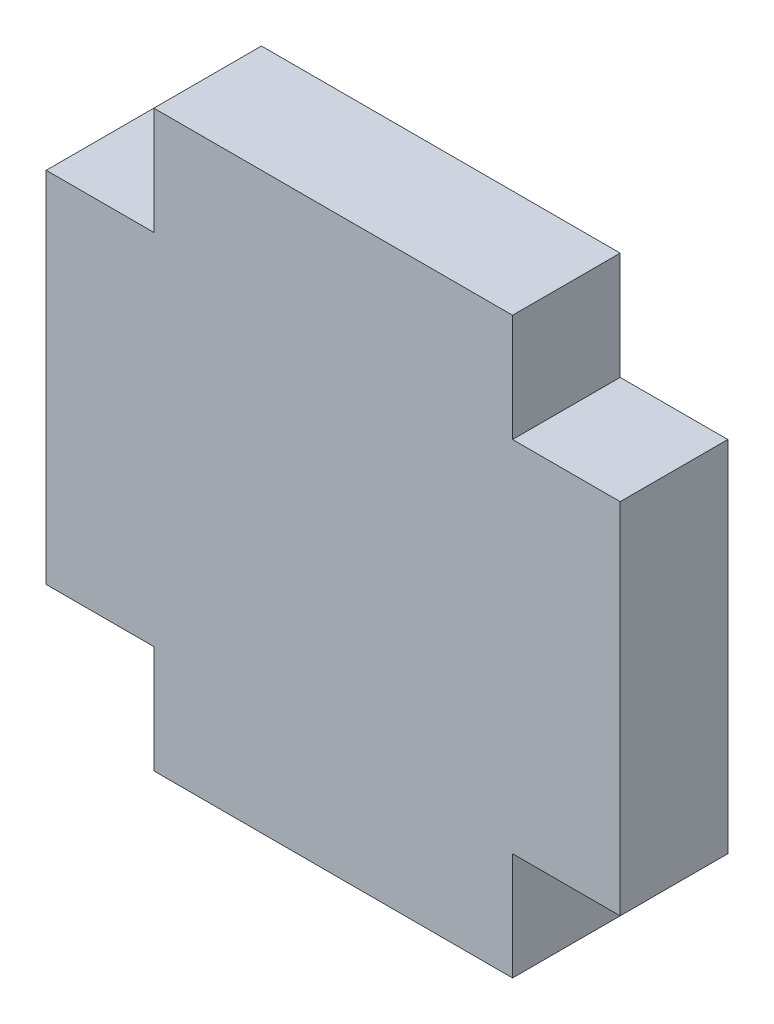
ISO-10303-21;
HEADER;
FILE_DESCRIPTION(('STEP AP214'),'2;1');
FILE_NAME('part.step','',(''),(''),'','','');
FILE_SCHEMA(('AUTOMOTIVE_DESIGN { 1 0 10303 214 1 1 1 1 }'));
ENDSEC;
DATA;
#1=APPLICATION_CONTEXT('core data for automotive mechanical design processes');
#2=APPLICATION_PROTOCOL_DEFINITION('international standard','automotive_design',2000,#1);
#3=PRODUCT_CONTEXT('',#1,'mechanical');
#4=PRODUCT('Part','Part','',(#3));
#5=PRODUCT_RELATED_PRODUCT_CATEGORY('part','',(#4));
#6=PRODUCT_DEFINITION_FORMATION('','',#4);
#7=PRODUCT_DEFINITION_CONTEXT('part definition',#1,'design');
#8=PRODUCT_DEFINITION('design','',#6,#7);
#9=PRODUCT_DEFINITION_SHAPE('','',#8);
#10=(LENGTH_UNIT() NAMED_UNIT(*) SI_UNIT(.MILLI.,.METRE.));
#11=(NAMED_UNIT(*) PLANE_ANGLE_UNIT() SI_UNIT($,.RADIAN.));
#12=(NAMED_UNIT(*) SI_UNIT($,.STERADIAN.) SOLID_ANGLE_UNIT());
#13=UNCERTAINTY_MEASURE_WITH_UNIT(LENGTH_MEASURE(1.E-05),#10,'distance_accuracy_value','');
#14=(GEOMETRIC_REPRESENTATION_CONTEXT(3) GLOBAL_UNCERTAINTY_ASSIGNED_CONTEXT((#13)) GLOBAL_UNIT_ASSIGNED_CONTEXT((#10,
#11,#12)) REPRESENTATION_CONTEXT('',''));
#15=CARTESIAN_POINT('',(0.,0.,0.));
#16=DIRECTION('',(0.,0.,1.));
#17=DIRECTION('',(1.,0.,0.));
#18=AXIS2_PLACEMENT_3D('',#15,#16,#17);
#19=CARTESIAN_POINT('',(5.,5.,3.));
#20=DIRECTION('',(-1.,0.,0.));
#21=DIRECTION('',(0.,-1.,0.));
#22=AXIS2_PLACEMENT_3D('',#19,#20,#21);
#23=PLANE('',#22);
#24=DIRECTION('',(0.,1.,0.));
#25=VECTOR('',#24,1.);
#26=CARTESIAN_POINT('',(5.,5.,0.));
#27=LINE('',#26,#25);
#28=CARTESIAN_POINT('',(5.,5.,0.));
#29=VERTEX_POINT('',#28);
#30=CARTESIAN_POINT('',(5.,8.,0.));
#31=VERTEX_POINT('',#30);
#32=EDGE_CURVE('E159',#29,#31,#27,.T.);
#33=ORIENTED_EDGE('',*,*,#32,.T.);
#34=DIRECTION('',(0.,0.,-1.));
#35=VECTOR('',#34,1.);
#36=CARTESIAN_POINT('',(5.,8.,3.));
#37=LINE('',#36,#35);
#38=CARTESIAN_POINT('',(5.,8.,3.));
#39=VERTEX_POINT('',#38);
#40=EDGE_CURVE('E11',#39,#31,#37,.T.);
#41=ORIENTED_EDGE('',*,*,#40,.F.);
#42=DIRECTION('',(0.,1.,0.));
#43=VECTOR('',#42,1.);
#44=CARTESIAN_POINT('',(5.,5.,3.));
#45=LINE('',#44,#43);
#46=CARTESIAN_POINT('',(5.,5.,3.));
#47=VERTEX_POINT('',#46);
#48=EDGE_CURVE('E181',#47,#39,#45,.T.);
#49=ORIENTED_EDGE('',*,*,#48,.F.);
#50=DIRECTION('',(0.,0.,-1.));
#51=VECTOR('',#50,1.);
#52=CARTESIAN_POINT('',(5.,5.,3.));
#53=LINE('',#52,#51);
#54=EDGE_CURVE('E151',#47,#29,#53,.T.);
#55=ORIENTED_EDGE('',*,*,#54,.T.);
#56=EDGE_LOOP('',(#33,#41,#49,#55));
#57=FACE_BOUND('',#56,.T.);
#58=ADVANCED_FACE('F39',(#57),#23,.F.);
#59=CARTESIAN_POINT('',(-5.,8.,3.));
#60=DIRECTION('',(0.,-1.,0.));
#61=DIRECTION('',(0.,0.,-1.));
#62=AXIS2_PLACEMENT_3D('',#59,#60,#61);
#63=PLANE('',#62);
#64=DIRECTION('',(-1.,0.,0.));
#65=VECTOR('',#64,1.);
#66=CARTESIAN_POINT('',(-5.,8.,0.));
#67=LINE('',#66,#65);
#68=CARTESIAN_POINT('',(-5.,8.,0.));
#69=VERTEX_POINT('',#68);
#70=EDGE_CURVE('E165',#31,#69,#67,.T.);
#71=ORIENTED_EDGE('',*,*,#70,.T.);
#72=DIRECTION('',(0.,0.,-1.));
#73=VECTOR('',#72,1.);
#74=CARTESIAN_POINT('',(-5.,8.,3.));
#75=LINE('',#74,#73);
#76=CARTESIAN_POINT('',(-5.,8.,3.));
#77=VERTEX_POINT('',#76);
#78=EDGE_CURVE('E50',#77,#69,#75,.T.);
#79=ORIENTED_EDGE('',*,*,#78,.F.);
#80=DIRECTION('',(-1.,0.,0.));
#81=VECTOR('',#80,1.);
#82=CARTESIAN_POINT('',(-5.,8.,3.));
#83=LINE('',#82,#81);
#84=EDGE_CURVE('E106',#39,#77,#83,.T.);
#85=ORIENTED_EDGE('',*,*,#84,.F.);
#86=ORIENTED_EDGE('',*,*,#40,.T.);
#87=EDGE_LOOP('',(#71,#79,#85,#86));
#88=FACE_BOUND('',#87,.T.);
#89=ADVANCED_FACE('F260',(#88),#63,.F.);
#90=CARTESIAN_POINT('',(-5.,5.,3.));
#91=DIRECTION('',(1.,0.,0.));
#92=DIRECTION('',(0.,1.,0.));
#93=AXIS2_PLACEMENT_3D('',#90,#91,#92);
#94=PLANE('',#93);
#95=DIRECTION('',(0.,-1.,0.));
#96=VECTOR('',#95,1.);
#97=CARTESIAN_POINT('',(-5.,5.,0.));
#98=LINE('',#97,#96);
#99=CARTESIAN_POINT('',(-5.,5.,0.));
#100=VERTEX_POINT('',#99);
#101=EDGE_CURVE('E164',#69,#100,#98,.T.);
#102=ORIENTED_EDGE('',*,*,#101,.T.);
#103=DIRECTION('',(0.,0.,-1.));
#104=VECTOR('',#103,1.);
#105=CARTESIAN_POINT('',(-5.,5.,3.));
#106=LINE('',#105,#104);
#107=CARTESIAN_POINT('',(-5.,5.,3.));
#108=VERTEX_POINT('',#107);
#109=EDGE_CURVE('E196',#108,#100,#106,.T.);
#110=ORIENTED_EDGE('',*,*,#109,.F.);
#111=DIRECTION('',(0.,-1.,0.));
#112=VECTOR('',#111,1.);
#113=CARTESIAN_POINT('',(-5.,5.,3.));
#114=LINE('',#113,#112);
#115=EDGE_CURVE('E208',#77,#108,#114,.T.);
#116=ORIENTED_EDGE('',*,*,#115,.F.);
#117=ORIENTED_EDGE('',*,*,#78,.T.);
#118=EDGE_LOOP('',(#102,#110,#116,#117));
#119=FACE_BOUND('',#118,.T.);
#120=ADVANCED_FACE('F207',(#119),#94,.F.);
#121=CARTESIAN_POINT('',(-5.,5.,3.));
#122=DIRECTION('',(0.,-1.,0.));
#123=DIRECTION('',(1.,0.,0.));
#124=AXIS2_PLACEMENT_3D('',#121,#122,#123);
#125=PLANE('',#124);
#126=DIRECTION('',(-1.,0.,0.));
#127=VECTOR('',#126,1.);
#128=CARTESIAN_POINT('',(-5.,5.,0.));
#129=LINE('',#128,#127);
#130=CARTESIAN_POINT('',(-8.,5.,0.));
#131=VERTEX_POINT('',#130);
#132=EDGE_CURVE('E168',#100,#131,#129,.T.);
#133=ORIENTED_EDGE('',*,*,#132,.T.);
#134=DIRECTION('',(0.,0.,-1.));
#135=VECTOR('',#134,1.);
#136=CARTESIAN_POINT('',(-8.,5.,3.));
#137=LINE('',#136,#135);
#138=CARTESIAN_POINT('',(-8.,5.,3.));
#139=VERTEX_POINT('',#138);
#140=EDGE_CURVE('E200',#139,#131,#137,.T.);
#141=ORIENTED_EDGE('',*,*,#140,.F.);
#142=DIRECTION('',(-1.,0.,0.));
#143=VECTOR('',#142,1.);
#144=CARTESIAN_POINT('',(-5.,5.,3.));
#145=LINE('',#144,#143);
#146=EDGE_CURVE('E226',#108,#139,#145,.T.);
#147=ORIENTED_EDGE('',*,*,#146,.F.);
#148=ORIENTED_EDGE('',*,*,#109,.T.);
#149=EDGE_LOOP('',(#133,#141,#147,#148));
#150=FACE_BOUND('',#149,.T.);
#151=ADVANCED_FACE('F220',(#150),#125,.F.);
#152=CARTESIAN_POINT('',(-8.,5.,3.));
#153=DIRECTION('',(1.,0.,0.));
#154=DIRECTION('',(0.,0.,-1.));
#155=AXIS2_PLACEMENT_3D('',#152,#153,#154);
#156=PLANE('',#155);
#157=DIRECTION('',(0.,-1.,0.));
#158=VECTOR('',#157,1.);
#159=CARTESIAN_POINT('',(-8.,5.,0.));
#160=LINE('',#159,#158);
#161=CARTESIAN_POINT('',(-8.,-5.,0.));
#162=VERTEX_POINT('',#161);
#163=EDGE_CURVE('E166',#131,#162,#160,.T.);
#164=ORIENTED_EDGE('',*,*,#163,.T.);
#165=DIRECTION('',(0.,0.,-1.));
#166=VECTOR('',#165,1.);
#167=CARTESIAN_POINT('',(-8.,-5.,3.));
#168=LINE('',#167,#166);
#169=CARTESIAN_POINT('',(-8.,-5.,3.));
#170=VERTEX_POINT('',#169);
#171=EDGE_CURVE('E191',#170,#162,#168,.T.);
#172=ORIENTED_EDGE('',*,*,#171,.F.);
#173=DIRECTION('',(0.,-1.,0.));
#174=VECTOR('',#173,1.);
#175=CARTESIAN_POINT('',(-8.,5.,3.));
#176=LINE('',#175,#174);
#177=EDGE_CURVE('E223',#139,#170,#176,.T.);
#178=ORIENTED_EDGE('',*,*,#177,.F.);
#179=ORIENTED_EDGE('',*,*,#140,.T.);
#180=EDGE_LOOP('',(#164,#172,#178,#179));
#181=FACE_BOUND('',#180,.T.);
#182=ADVANCED_FACE('F221',(#181),#156,.F.);
#183=CARTESIAN_POINT('',(-5.,-5.,3.));
#184=DIRECTION('',(0.,1.,0.));
#185=DIRECTION('',(0.,0.,1.));
#186=AXIS2_PLACEMENT_3D('',#183,#184,#185);
#187=PLANE('',#186);
#188=DIRECTION('',(1.,0.,0.));
#189=VECTOR('',#188,1.);
#190=CARTESIAN_POINT('',(-5.,-5.,0.));
#191=LINE('',#190,#189);
#192=CARTESIAN_POINT('',(-5.,-5.,0.));
#193=VERTEX_POINT('',#192);
#194=EDGE_CURVE('E169',#162,#193,#191,.T.);
#195=ORIENTED_EDGE('',*,*,#194,.T.);
#196=DIRECTION('',(0.,0.,-1.));
#197=VECTOR('',#196,1.);
#198=CARTESIAN_POINT('',(-5.,-5.,3.));
#199=LINE('',#198,#197);
#200=CARTESIAN_POINT('',(-5.,-5.,3.));
#201=VERTEX_POINT('',#200);
#202=EDGE_CURVE('E192',#201,#193,#199,.T.);
#203=ORIENTED_EDGE('',*,*,#202,.F.);
#204=DIRECTION('',(1.,0.,0.));
#205=VECTOR('',#204,1.);
#206=CARTESIAN_POINT('',(-5.,-5.,3.));
#207=LINE('',#206,#205);
#208=EDGE_CURVE('E224',#170,#201,#207,.T.);
#209=ORIENTED_EDGE('',*,*,#208,.F.);
#210=ORIENTED_EDGE('',*,*,#171,.T.);
#211=EDGE_LOOP('',(#195,#203,#209,#210));
#212=FACE_BOUND('',#211,.T.);
#213=ADVANCED_FACE('F275',(#212),#187,.F.);
#214=CARTESIAN_POINT('',(-5.,-5.,3.));
#215=DIRECTION('',(1.,0.,0.));
#216=DIRECTION('',(0.,1.,0.));
#217=AXIS2_PLACEMENT_3D('',#214,#215,#216);
#218=PLANE('',#217);
#219=DIRECTION('',(0.,-1.,0.));
#220=VECTOR('',#219,1.);
#221=CARTESIAN_POINT('',(-5.,-5.,0.));
#222=LINE('',#221,#220);
#223=CARTESIAN_POINT('',(-5.,-8.,0.));
#224=VERTEX_POINT('',#223);
#225=EDGE_CURVE('E175',#193,#224,#222,.T.);
#226=ORIENTED_EDGE('',*,*,#225,.T.);
#227=DIRECTION('',(0.,0.,-1.));
#228=VECTOR('',#227,1.);
#229=CARTESIAN_POINT('',(-5.,-8.,3.));
#230=LINE('',#229,#228);
#231=CARTESIAN_POINT('',(-5.,-8.,3.));
#232=VERTEX_POINT('',#231);
#233=EDGE_CURVE('E187',#232,#224,#230,.T.);
#234=ORIENTED_EDGE('',*,*,#233,.F.);
#235=DIRECTION('',(0.,-1.,0.));
#236=VECTOR('',#235,1.);
#237=CARTESIAN_POINT('',(-5.,-5.,3.));
#238=LINE('',#237,#236);
#239=EDGE_CURVE('E228',#201,#232,#238,.T.);
#240=ORIENTED_EDGE('',*,*,#239,.F.);
#241=ORIENTED_EDGE('',*,*,#202,.T.);
#242=EDGE_LOOP('',(#226,#234,#240,#241));
#243=FACE_BOUND('',#242,.T.);
#244=ADVANCED_FACE('F274',(#243),#218,.F.);
#245=CARTESIAN_POINT('',(-5.,-8.,3.));
#246=DIRECTION('',(0.,1.,0.));
#247=DIRECTION('',(0.,0.,1.));
#248=AXIS2_PLACEMENT_3D('',#245,#246,#247);
#249=PLANE('',#248);
#250=DIRECTION('',(1.,0.,0.));
#251=VECTOR('',#250,1.);
#252=CARTESIAN_POINT('',(-5.,-8.,0.));
#253=LINE('',#252,#251);
#254=CARTESIAN_POINT('',(5.,-8.,0.));
#255=VERTEX_POINT('',#254);
#256=EDGE_CURVE('E174',#224,#255,#253,.T.);
#257=ORIENTED_EDGE('',*,*,#256,.T.);
#258=DIRECTION('',(0.,0.,-1.));
#259=VECTOR('',#258,1.);
#260=CARTESIAN_POINT('',(5.,-8.,3.));
#261=LINE('',#260,#259);
#262=CARTESIAN_POINT('',(5.,-8.,3.));
#263=VERTEX_POINT('',#262);
#264=EDGE_CURVE('E184',#263,#255,#261,.T.);
#265=ORIENTED_EDGE('',*,*,#264,.F.);
#266=DIRECTION('',(1.,0.,0.));
#267=VECTOR('',#266,1.);
#268=CARTESIAN_POINT('',(-5.,-8.,3.));
#269=LINE('',#268,#267);
#270=EDGE_CURVE('E233',#232,#263,#269,.T.);
#271=ORIENTED_EDGE('',*,*,#270,.F.);
#272=ORIENTED_EDGE('',*,*,#233,.T.);
#273=EDGE_LOOP('',(#257,#265,#271,#272));
#274=FACE_BOUND('',#273,.T.);
#275=ADVANCED_FACE('F238',(#274),#249,.F.);
#276=CARTESIAN_POINT('',(5.,-5.,3.));
#277=DIRECTION('',(-1.,0.,0.));
#278=DIRECTION('',(0.,-1.,0.));
#279=AXIS2_PLACEMENT_3D('',#276,#277,#278);
#280=PLANE('',#279);
#281=DIRECTION('',(0.,1.,0.));
#282=VECTOR('',#281,1.);
#283=CARTESIAN_POINT('',(5.,-5.,0.));
#284=LINE('',#283,#282);
#285=CARTESIAN_POINT('',(5.,-5.,0.));
#286=VERTEX_POINT('',#285);
#287=EDGE_CURVE('E176',#255,#286,#284,.T.);
#288=ORIENTED_EDGE('',*,*,#287,.T.);
#289=DIRECTION('',(0.,0.,-1.));
#290=VECTOR('',#289,1.);
#291=CARTESIAN_POINT('',(5.,-5.,3.));
#292=LINE('',#291,#290);
#293=CARTESIAN_POINT('',(5.,-5.,3.));
#294=VERTEX_POINT('',#293);
#295=EDGE_CURVE('E148',#294,#286,#292,.T.);
#296=ORIENTED_EDGE('',*,*,#295,.F.);
#297=DIRECTION('',(0.,1.,0.));
#298=VECTOR('',#297,1.);
#299=CARTESIAN_POINT('',(5.,-5.,3.));
#300=LINE('',#299,#298);
#301=EDGE_CURVE('E141',#263,#294,#300,.T.);
#302=ORIENTED_EDGE('',*,*,#301,.F.);
#303=ORIENTED_EDGE('',*,*,#264,.T.);
#304=EDGE_LOOP('',(#288,#296,#302,#303));
#305=FACE_BOUND('',#304,.T.);
#306=ADVANCED_FACE('F244',(#305),#280,.F.);
#307=CARTESIAN_POINT('',(5.,-5.,3.));
#308=DIRECTION('',(0.,1.,0.));
#309=DIRECTION('',(0.,0.,1.));
#310=AXIS2_PLACEMENT_3D('',#307,#308,#309);
#311=PLANE('',#310);
#312=DIRECTION('',(1.,0.,0.));
#313=VECTOR('',#312,1.);
#314=CARTESIAN_POINT('',(5.,-5.,0.));
#315=LINE('',#314,#313);
#316=CARTESIAN_POINT('',(8.,-5.,0.));
#317=VERTEX_POINT('',#316);
#318=EDGE_CURVE('E146',#286,#317,#315,.T.);
#319=ORIENTED_EDGE('',*,*,#318,.T.);
#320=DIRECTION('',(0.,0.,-1.));
#321=VECTOR('',#320,1.);
#322=CARTESIAN_POINT('',(8.,-5.,3.));
#323=LINE('',#322,#321);
#324=CARTESIAN_POINT('',(8.,-5.,3.));
#325=VERTEX_POINT('',#324);
#326=EDGE_CURVE('E147',#325,#317,#323,.T.);
#327=ORIENTED_EDGE('',*,*,#326,.F.);
#328=DIRECTION('',(1.,0.,0.));
#329=VECTOR('',#328,1.);
#330=CARTESIAN_POINT('',(5.,-5.,3.));
#331=LINE('',#330,#329);
#332=EDGE_CURVE('E134',#294,#325,#331,.T.);
#333=ORIENTED_EDGE('',*,*,#332,.F.);
#334=ORIENTED_EDGE('',*,*,#295,.T.);
#335=EDGE_LOOP('',(#319,#327,#333,#334));
#336=FACE_BOUND('',#335,.T.);
#337=ADVANCED_FACE('F150',(#336),#311,.F.);
#338=CARTESIAN_POINT('',(8.,5.,3.));
#339=DIRECTION('',(-1.,0.,0.));
#340=DIRECTION('',(0.,0.,1.));
#341=AXIS2_PLACEMENT_3D('',#338,#339,#340);
#342=PLANE('',#341);
#343=DIRECTION('',(0.,1.,0.));
#344=VECTOR('',#343,1.);
#345=CARTESIAN_POINT('',(8.,5.,0.));
#346=LINE('',#345,#344);
#347=CARTESIAN_POINT('',(8.,5.,0.));
#348=VERTEX_POINT('',#347);
#349=EDGE_CURVE('E96',#317,#348,#346,.T.);
#350=ORIENTED_EDGE('',*,*,#349,.T.);
#351=DIRECTION('',(0.,0.,-1.));
#352=VECTOR('',#351,1.);
#353=CARTESIAN_POINT('',(8.,5.,3.));
#354=LINE('',#353,#352);
#355=CARTESIAN_POINT('',(8.,5.,3.));
#356=VERTEX_POINT('',#355);
#357=EDGE_CURVE('E152',#356,#348,#354,.T.);
#358=ORIENTED_EDGE('',*,*,#357,.F.);
#359=DIRECTION('',(0.,1.,0.));
#360=VECTOR('',#359,1.);
#361=CARTESIAN_POINT('',(8.,5.,3.));
#362=LINE('',#361,#360);
#363=EDGE_CURVE('E137',#325,#356,#362,.T.);
#364=ORIENTED_EDGE('',*,*,#363,.F.);
#365=ORIENTED_EDGE('',*,*,#326,.T.);
#366=EDGE_LOOP('',(#350,#358,#364,#365));
#367=FACE_BOUND('',#366,.T.);
#368=ADVANCED_FACE('F153',(#367),#342,.F.);
#369=CARTESIAN_POINT('',(5.,5.,3.));
#370=DIRECTION('',(0.,-1.,0.));
#371=DIRECTION('',(1.,0.,0.));
#372=AXIS2_PLACEMENT_3D('',#369,#370,#371);
#373=PLANE('',#372);
#374=DIRECTION('',(-1.,0.,0.));
#375=VECTOR('',#374,1.);
#376=CARTESIAN_POINT('',(5.,5.,0.));
#377=LINE('',#376,#375);
#378=EDGE_CURVE('E105',#348,#29,#377,.T.);
#379=ORIENTED_EDGE('',*,*,#378,.T.);
#380=ORIENTED_EDGE('',*,*,#54,.F.);
#381=DIRECTION('',(-1.,0.,0.));
#382=VECTOR('',#381,1.);
#383=CARTESIAN_POINT('',(5.,5.,3.));
#384=LINE('',#383,#382);
#385=EDGE_CURVE('E54',#356,#47,#384,.T.);
#386=ORIENTED_EDGE('',*,*,#385,.F.);
#387=ORIENTED_EDGE('',*,*,#357,.T.);
#388=EDGE_LOOP('',(#379,#380,#386,#387));
#389=FACE_BOUND('',#388,.T.);
#390=ADVANCED_FACE('F246',(#389),#373,.F.);
#391=CARTESIAN_POINT('',(0.,0.,3.));
#392=DIRECTION('',(0.,0.,-1.));
#393=DIRECTION('',(-1.,0.,0.));
#394=AXIS2_PLACEMENT_3D('',#391,#392,#393);
#395=PLANE('',#394);
#396=ORIENTED_EDGE('',*,*,#48,.T.);
#397=ORIENTED_EDGE('',*,*,#84,.T.);
#398=ORIENTED_EDGE('',*,*,#115,.T.);
#399=ORIENTED_EDGE('',*,*,#146,.T.);
#400=ORIENTED_EDGE('',*,*,#177,.T.);
#401=ORIENTED_EDGE('',*,*,#208,.T.);
#402=ORIENTED_EDGE('',*,*,#239,.T.);
#403=ORIENTED_EDGE('',*,*,#270,.T.);
#404=ORIENTED_EDGE('',*,*,#301,.T.);
#405=ORIENTED_EDGE('',*,*,#332,.T.);
#406=ORIENTED_EDGE('',*,*,#363,.T.);
#407=ORIENTED_EDGE('',*,*,#385,.T.);
#408=EDGE_LOOP('',(#396,#397,#398,#399,#400,#401,#402,#403,#404,#405,#406,#407));
#409=FACE_BOUND('',#408,.T.);
#410=ADVANCED_FACE('F140',(#409),#395,.F.);
#411=CARTESIAN_POINT('',(0.,0.,0.));
#412=DIRECTION('',(0.,0.,-1.));
#413=DIRECTION('',(-1.,0.,0.));
#414=AXIS2_PLACEMENT_3D('',#411,#412,#413);
#415=PLANE('',#414);
#416=ORIENTED_EDGE('',*,*,#32,.F.);
#417=ORIENTED_EDGE('',*,*,#378,.F.);
#418=ORIENTED_EDGE('',*,*,#349,.F.);
#419=ORIENTED_EDGE('',*,*,#318,.F.);
#420=ORIENTED_EDGE('',*,*,#287,.F.);
#421=ORIENTED_EDGE('',*,*,#256,.F.);
#422=ORIENTED_EDGE('',*,*,#225,.F.);
#423=ORIENTED_EDGE('',*,*,#194,.F.);
#424=ORIENTED_EDGE('',*,*,#163,.F.);
#425=ORIENTED_EDGE('',*,*,#132,.F.);
#426=ORIENTED_EDGE('',*,*,#101,.F.);
#427=ORIENTED_EDGE('',*,*,#70,.F.);
#428=EDGE_LOOP('',(#416,#417,#418,#419,#420,#421,#422,#423,#424,#425,#426,#427));
#429=FACE_BOUND('',#428,.T.);
#430=ADVANCED_FACE('F212',(#429),#415,.T.);
#431=CLOSED_SHELL('',(#58,#89,#120,#151,#182,#213,#244,#275,#306,#337,#368,#390,#410,#430));
#432=MANIFOLD_SOLID_BREP('B2',#431);
#433=ADVANCED_BREP_SHAPE_REPRESENTATION('',(#18,#432),#14);
#434=SHAPE_DEFINITION_REPRESENTATION(#9,#433);
ENDSEC;
END-ISO-10303-21;
